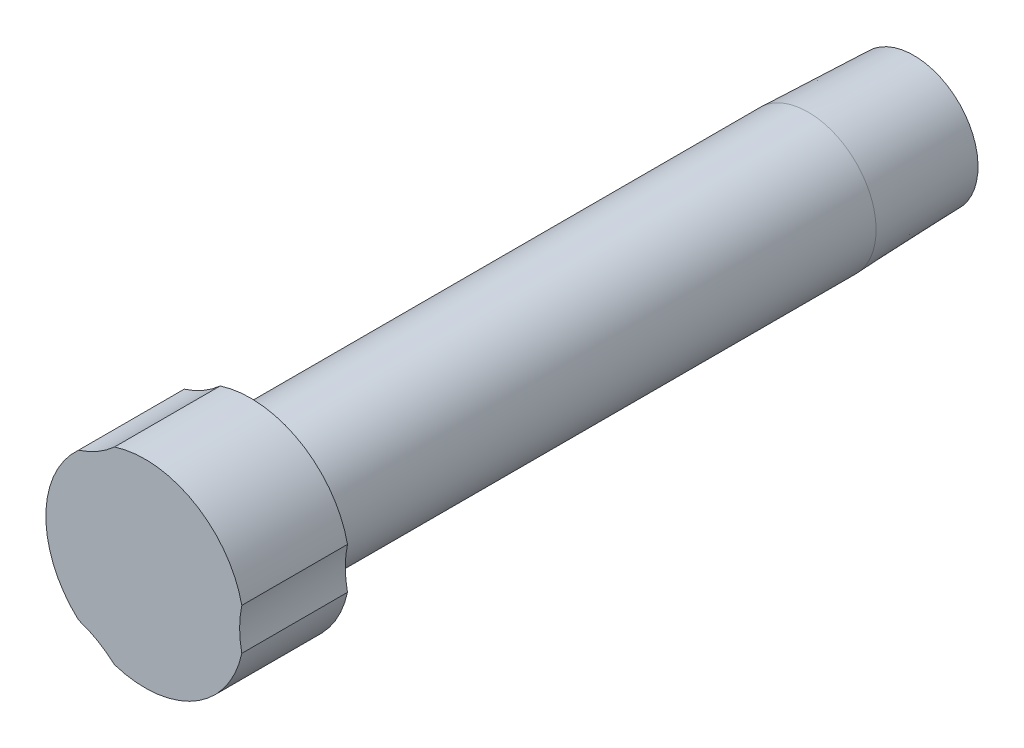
ISO-10303-21;
HEADER;
FILE_DESCRIPTION(('STEP AP214'),'2;1');
FILE_NAME('part.step','',(''),(''),'','','');
FILE_SCHEMA(('AUTOMOTIVE_DESIGN { 1 0 10303 214 1 1 1 1 }'));
ENDSEC;
DATA;
#1=APPLICATION_CONTEXT('core data for automotive mechanical design processes');
#2=APPLICATION_PROTOCOL_DEFINITION('international standard','automotive_design',2000,#1);
#3=PRODUCT_CONTEXT('',#1,'mechanical');
#4=PRODUCT('Part','Part','',(#3));
#5=PRODUCT_RELATED_PRODUCT_CATEGORY('part','',(#4));
#6=PRODUCT_DEFINITION_FORMATION('','',#4);
#7=PRODUCT_DEFINITION_CONTEXT('part definition',#1,'design');
#8=PRODUCT_DEFINITION('design','',#6,#7);
#9=PRODUCT_DEFINITION_SHAPE('','',#8);
#10=(LENGTH_UNIT() NAMED_UNIT(*) SI_UNIT(.MILLI.,.METRE.));
#11=(NAMED_UNIT(*) PLANE_ANGLE_UNIT() SI_UNIT($,.RADIAN.));
#12=(NAMED_UNIT(*) SI_UNIT($,.STERADIAN.) SOLID_ANGLE_UNIT());
#13=UNCERTAINTY_MEASURE_WITH_UNIT(LENGTH_MEASURE(1.E-05),#10,'distance_accuracy_value','');
#14=(GEOMETRIC_REPRESENTATION_CONTEXT(3) GLOBAL_UNCERTAINTY_ASSIGNED_CONTEXT((#13)) GLOBAL_UNIT_ASSIGNED_CONTEXT((#10,
#11,#12)) REPRESENTATION_CONTEXT('',''));
#15=CARTESIAN_POINT('',(0.,0.,0.));
#16=DIRECTION('',(0.,0.,1.));
#17=DIRECTION('',(1.,0.,0.));
#18=AXIS2_PLACEMENT_3D('',#15,#16,#17);
#19=CARTESIAN_POINT('',(-1.83333333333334,43.,0.));
#20=DIRECTION('',(0.,0.,1.));
#21=DIRECTION('',(1.,0.,0.));
#22=AXIS2_PLACEMENT_3D('',#19,#20,#21);
#23=PLANE('',#22);
#24=CARTESIAN_POINT('',(-1.83333333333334,43.,0.));
#25=DIRECTION('',(0.,0.,1.));
#26=DIRECTION('',(1.,0.,0.));
#27=AXIS2_PLACEMENT_3D('',#24,#25,#26);
#28=CIRCLE('',#27,2.57);
#29=CARTESIAN_POINT('',(0.736666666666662,43.,0.));
#30=VERTEX_POINT('',#29);
#31=EDGE_CURVE('E114',#30,#30,#28,.T.);
#32=ORIENTED_EDGE('',*,*,#31,.T.);
#33=EDGE_LOOP('',(#32));
#34=FACE_BOUND('',#33,.T.);
#35=CARTESIAN_POINT('',(-5.50000000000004,49.3508529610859,0.));
#36=DIRECTION('',(0.,0.,1.));
#37=DIRECTION('',(1.,0.,0.));
#38=AXIS2_PLACEMENT_3D('',#35,#36,#37);
#39=CIRCLE('',#38,3.75);
#40=CARTESIAN_POINT('',(-4.34750560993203,45.7823439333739,0.));
#41=VERTEX_POINT('',#40);
#42=CARTESIAN_POINT('',(-2.98582772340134,46.568509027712,0.));
#43=VERTEX_POINT('',#42);
#44=EDGE_CURVE('E91',#41,#43,#39,.T.);
#45=ORIENTED_EDGE('',*,*,#44,.T.);
#46=CARTESIAN_POINT('',(-1.83333333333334,43.,0.));
#47=DIRECTION('',(0.,0.,1.));
#48=DIRECTION('',(1.,0.,0.));
#49=AXIS2_PLACEMENT_3D('',#46,#47,#48);
#50=CIRCLE('',#49,3.75);
#51=CARTESIAN_POINT('',(1.83333333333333,43.786165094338,1.90993054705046E-11));
#52=VERTEX_POINT('',#51);
#53=EDGE_CURVE('E100',#52,#43,#50,.T.);
#54=ORIENTED_EDGE('',*,*,#53,.F.);
#55=CARTESIAN_POINT('',(5.5,43.,1.90993054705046E-11));
#56=DIRECTION('',(0.,0.,1.));
#57=DIRECTION('',(1.,0.,0.));
#58=AXIS2_PLACEMENT_3D('',#55,#56,#57);
#59=CIRCLE('',#58,3.75);
#60=CARTESIAN_POINT('',(1.83333333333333,42.213834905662,1.90993054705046E-11));
#61=VERTEX_POINT('',#60);
#62=EDGE_CURVE('E240',#52,#61,#59,.T.);
#63=ORIENTED_EDGE('',*,*,#62,.T.);
#64=CARTESIAN_POINT('',(-2.98582772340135,39.431490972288,1.90993054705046E-11));
#65=VERTEX_POINT('',#64);
#66=EDGE_CURVE('E111',#65,#61,#50,.T.);
#67=ORIENTED_EDGE('',*,*,#66,.F.);
#68=CARTESIAN_POINT('',(-5.50000000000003,36.6491470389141,1.90993054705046E-11));
#69=DIRECTION('',(0.,0.,1.));
#70=DIRECTION('',(1.,0.,0.));
#71=AXIS2_PLACEMENT_3D('',#68,#69,#70);
#72=CIRCLE('',#71,3.75);
#73=CARTESIAN_POINT('',(-4.34750560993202,40.2176560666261,1.90993054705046E-11));
#74=VERTEX_POINT('',#73);
#75=EDGE_CURVE('E101',#65,#74,#72,.T.);
#76=ORIENTED_EDGE('',*,*,#75,.T.);
#77=EDGE_CURVE('E109',#41,#74,#50,.T.);
#78=ORIENTED_EDGE('',*,*,#77,.F.);
#79=EDGE_LOOP('',(#45,#54,#63,#67,#76,#78));
#80=FACE_BOUND('',#79,.T.);
#81=ADVANCED_FACE('F33',(#34,#80),#23,.F.);
#82=CARTESIAN_POINT('',(-1.83333333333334,43.,14.6066017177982));
#83=DIRECTION('',(0.,0.,-1.));
#84=DIRECTION('',(-1.,0.,0.));
#85=AXIS2_PLACEMENT_3D('',#82,#83,#84);
#86=CYLINDRICAL_SURFACE('',#85,3.75);
#87=DIRECTION('',(0.,0.,-1.));
#88=VECTOR('',#87,1.);
#89=CARTESIAN_POINT('',(-2.98582772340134,46.568509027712,2.));
#90=LINE('',#89,#88);
#91=CARTESIAN_POINT('',(-2.98582772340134,46.568509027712,4.));
#92=VERTEX_POINT('',#91);
#93=EDGE_CURVE('E85',#92,#43,#90,.T.);
#94=ORIENTED_EDGE('',*,*,#93,.F.);
#95=CARTESIAN_POINT('',(-1.83333333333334,43.,4.));
#96=DIRECTION('',(0.,0.,-1.));
#97=DIRECTION('',(-1.,0.,0.));
#98=AXIS2_PLACEMENT_3D('',#95,#96,#97);
#99=CIRCLE('',#98,3.75);
#100=CARTESIAN_POINT('',(1.83333333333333,43.786165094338,4.));
#101=VERTEX_POINT('',#100);
#102=EDGE_CURVE('E97',#92,#101,#99,.T.);
#103=ORIENTED_EDGE('',*,*,#102,.T.);
#104=DIRECTION('',(0.,0.,-1.));
#105=VECTOR('',#104,1.);
#106=CARTESIAN_POINT('',(1.83333333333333,43.786165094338,2.0000000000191));
#107=LINE('',#106,#105);
#108=EDGE_CURVE('E251',#52,#101,#107,.F.);
#109=ORIENTED_EDGE('',*,*,#108,.F.);
#110=ORIENTED_EDGE('',*,*,#53,.T.);
#111=EDGE_LOOP('',(#94,#103,#109,#110));
#112=FACE_BOUND('',#111,.T.);
#113=ADVANCED_FACE('F95',(#112),#86,.T.);
#114=DIRECTION('',(0.,0.,-1.));
#115=VECTOR('',#114,1.);
#116=CARTESIAN_POINT('',(-4.34750560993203,45.7823439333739,2.));
#117=LINE('',#116,#115);
#118=CARTESIAN_POINT('',(-4.34750560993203,45.7823439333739,4.));
#119=VERTEX_POINT('',#118);
#120=EDGE_CURVE('E48',#41,#119,#117,.F.);
#121=ORIENTED_EDGE('',*,*,#120,.F.);
#122=ORIENTED_EDGE('',*,*,#77,.T.);
#123=DIRECTION('',(0.,0.,-1.));
#124=VECTOR('',#123,1.);
#125=CARTESIAN_POINT('',(-4.34750560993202,40.2176560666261,2.0000000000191));
#126=LINE('',#125,#124);
#127=CARTESIAN_POINT('',(-4.34750560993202,40.2176560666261,4.0000000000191));
#128=VERTEX_POINT('',#127);
#129=EDGE_CURVE('E237',#128,#74,#126,.T.);
#130=ORIENTED_EDGE('',*,*,#129,.F.);
#131=EDGE_CURVE('E106',#128,#119,#99,.T.);
#132=ORIENTED_EDGE('',*,*,#131,.T.);
#133=EDGE_LOOP('',(#121,#122,#130,#132));
#134=FACE_BOUND('',#133,.T.);
#135=ADVANCED_FACE('F141',(#134),#86,.T.);
#136=CARTESIAN_POINT('',(-27.5,68.,4.));
#137=DIRECTION('',(0.,0.,-1.));
#138=DIRECTION('',(-1.,0.,0.));
#139=AXIS2_PLACEMENT_3D('',#136,#137,#138);
#140=PLANE('',#139);
#141=CARTESIAN_POINT('',(-5.50000000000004,49.3508529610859,4.));
#142=DIRECTION('',(0.,0.,-1.));
#143=DIRECTION('',(-1.,0.,0.));
#144=AXIS2_PLACEMENT_3D('',#141,#142,#143);
#145=CIRCLE('',#144,3.75);
#146=EDGE_CURVE('E82',#92,#119,#145,.T.);
#147=ORIENTED_EDGE('',*,*,#146,.T.);
#148=ORIENTED_EDGE('',*,*,#131,.F.);
#149=CARTESIAN_POINT('',(-5.50000000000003,36.6491470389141,4.0000000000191));
#150=DIRECTION('',(0.,0.,-1.));
#151=DIRECTION('',(-1.,0.,0.));
#152=AXIS2_PLACEMENT_3D('',#149,#150,#151);
#153=CIRCLE('',#152,3.75);
#154=CARTESIAN_POINT('',(-2.98582772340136,39.431490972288,4.));
#155=VERTEX_POINT('',#154);
#156=EDGE_CURVE('E239',#128,#155,#153,.T.);
#157=ORIENTED_EDGE('',*,*,#156,.T.);
#158=CARTESIAN_POINT('',(1.83333333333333,42.213834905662,4.0000000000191));
#159=VERTEX_POINT('',#158);
#160=EDGE_CURVE('E108',#159,#155,#99,.T.);
#161=ORIENTED_EDGE('',*,*,#160,.F.);
#162=CARTESIAN_POINT('',(5.5,43.,4.));
#163=DIRECTION('',(0.,0.,-1.));
#164=DIRECTION('',(-1.,0.,0.));
#165=AXIS2_PLACEMENT_3D('',#162,#163,#164);
#166=CIRCLE('',#165,3.75);
#167=EDGE_CURVE('E11',#101,#159,#166,.F.);
#168=ORIENTED_EDGE('',*,*,#167,.F.);
#169=ORIENTED_EDGE('',*,*,#102,.F.);
#170=EDGE_LOOP('',(#147,#148,#157,#161,#168,#169));
#171=FACE_BOUND('',#170,.T.);
#172=ADVANCED_FACE('F104',(#171),#140,.F.);
#173=DIRECTION('',(0.,0.,-1.));
#174=VECTOR('',#173,1.);
#175=CARTESIAN_POINT('',(-2.98582772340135,39.431490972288,2.0000000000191));
#176=LINE('',#175,#174);
#177=EDGE_CURVE('E56',#65,#155,#176,.F.);
#178=ORIENTED_EDGE('',*,*,#177,.F.);
#179=ORIENTED_EDGE('',*,*,#66,.T.);
#180=DIRECTION('',(0.,0.,-1.));
#181=VECTOR('',#180,1.);
#182=CARTESIAN_POINT('',(1.83333333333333,42.213834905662,2.0000000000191));
#183=LINE('',#182,#181);
#184=EDGE_CURVE('E253',#159,#61,#183,.T.);
#185=ORIENTED_EDGE('',*,*,#184,.F.);
#186=ORIENTED_EDGE('',*,*,#160,.T.);
#187=EDGE_LOOP('',(#178,#179,#185,#186));
#188=FACE_BOUND('',#187,.T.);
#189=ADVANCED_FACE('F132',(#188),#86,.T.);
#190=CARTESIAN_POINT('',(-3.66666666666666,39.824573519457,-25.1));
#191=DIRECTION('',(0.,0.,-1.));
#192=DIRECTION('',(0.866025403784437,0.500000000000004,0.));
#193=AXIS2_PLACEMENT_3D('',#190,#191,#192);
#194=PLANE('',#193);
#195=CARTESIAN_POINT('',(-1.83333333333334,43.,-25.1));
#196=DIRECTION('',(0.,0.,-1.));
#197=DIRECTION('',(0.866025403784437,0.500000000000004,0.));
#198=AXIS2_PLACEMENT_3D('',#195,#196,#197);
#199=CIRCLE('',#198,2.4301584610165);
#200=CARTESIAN_POINT('',(0.271245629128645,44.2150792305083,-25.1));
#201=VERTEX_POINT('',#200);
#202=EDGE_CURVE('E122',#201,#201,#199,.F.);
#203=ORIENTED_EDGE('',*,*,#202,.F.);
#204=EDGE_LOOP('',(#203));
#205=FACE_BOUND('',#204,.T.);
#206=ADVANCED_FACE('F130',(#205),#194,.T.);
#207=CARTESIAN_POINT('',(-1.83333333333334,43.,-23.1));
#208=DIRECTION('',(0.,0.,1.));
#209=DIRECTION('',(0.866025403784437,0.500000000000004,0.));
#210=AXIS2_PLACEMENT_3D('',#207,#208,#209);
#211=CONICAL_SURFACE('',#210,2.5,0.0349065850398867);
#212=CARTESIAN_POINT('',(-1.83333333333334,43.,-21.1));
#213=DIRECTION('',(0.,0.,-1.));
#214=DIRECTION('',(0.866025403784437,0.500000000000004,0.));
#215=AXIS2_PLACEMENT_3D('',#212,#213,#214);
#216=CIRCLE('',#215,2.5698415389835);
#217=CARTESIAN_POINT('',(0.392214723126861,44.2849207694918,-21.1));
#218=VERTEX_POINT('',#217);
#219=EDGE_CURVE('E41',#218,#218,#216,.T.);
#220=ORIENTED_EDGE('',*,*,#219,.T.);
#221=EDGE_LOOP('',(#220));
#222=FACE_BOUND('',#221,.T.);
#223=ORIENTED_EDGE('',*,*,#202,.T.);
#224=EDGE_LOOP('',(#223));
#225=FACE_BOUND('',#224,.T.);
#226=ADVANCED_FACE('F35',(#222,#225),#211,.T.);
#227=CARTESIAN_POINT('',(-5.50000000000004,49.3508529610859,-21.1));
#228=DIRECTION('',(0.,0.,1.));
#229=DIRECTION('',(-0.866025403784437,-0.500000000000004,0.));
#230=AXIS2_PLACEMENT_3D('',#227,#228,#229);
#231=PLANE('',#230);
#232=CARTESIAN_POINT('',(-1.83333333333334,43.,-21.0999999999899));
#233=DIRECTION('',(0.,0.,1.));
#234=DIRECTION('',(0.,-1.,0.));
#235=AXIS2_PLACEMENT_3D('',#232,#233,#234);
#236=CIRCLE('',#235,2.57);
#237=CARTESIAN_POINT('',(0.736666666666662,43.,-21.1000000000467));
#238=VERTEX_POINT('',#237);
#239=EDGE_CURVE('E118',#238,#238,#236,.F.);
#240=ORIENTED_EDGE('',*,*,#239,.T.);
#241=EDGE_LOOP('',(#240));
#242=FACE_BOUND('',#241,.T.);
#243=ORIENTED_EDGE('',*,*,#219,.F.);
#244=EDGE_LOOP('',(#243));
#245=FACE_BOUND('',#244,.T.);
#246=ADVANCED_FACE('F138',(#242,#245),#231,.F.);
#247=CARTESIAN_POINT('',(-1.83333333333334,43.,-500000.));
#248=DIRECTION('',(0.,0.,1.));
#249=DIRECTION('',(1.,0.,0.));
#250=AXIS2_PLACEMENT_3D('',#247,#248,#249);
#251=CYLINDRICAL_SURFACE('',#250,2.57);
#252=CARTESIAN_POINT('',(0.736666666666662,43.,-21.1000000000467));
#253=CARTESIAN_POINT('',(0.736666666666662,43.,-20.8802083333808));
#254=CARTESIAN_POINT('',(0.736666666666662,43.,-20.6604166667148));
#255=CARTESIAN_POINT('',(0.736666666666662,43.,-20.2208333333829));
#256=CARTESIAN_POINT('',(0.736666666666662,43.,-20.0010416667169));
#257=CARTESIAN_POINT('',(0.736666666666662,43.,-19.561458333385));
#258=CARTESIAN_POINT('',(0.736666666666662,43.,-19.341666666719));
#259=CARTESIAN_POINT('',(0.736666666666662,43.,-18.9020833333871));
#260=CARTESIAN_POINT('',(0.736666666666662,43.,-18.6822916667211));
#261=CARTESIAN_POINT('',(0.736666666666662,43.,-18.2427083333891));
#262=CARTESIAN_POINT('',(0.736666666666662,43.,-18.0229166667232));
#263=CARTESIAN_POINT('',(0.736666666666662,43.,-17.5833333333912));
#264=CARTESIAN_POINT('',(0.736666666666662,43.,-17.3635416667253));
#265=CARTESIAN_POINT('',(0.736666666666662,43.,-16.9239583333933));
#266=CARTESIAN_POINT('',(0.736666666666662,43.,-16.7041666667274));
#267=CARTESIAN_POINT('',(0.736666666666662,43.,-16.2645833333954));
#268=CARTESIAN_POINT('',(0.736666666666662,43.,-16.0447916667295));
#269=CARTESIAN_POINT('',(0.736666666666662,43.,-15.6052083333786));
#270=CARTESIAN_POINT('',(0.736666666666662,43.,-15.3854166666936));
#271=CARTESIAN_POINT('',(0.736666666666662,43.,-14.9458333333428));
#272=CARTESIAN_POINT('',(0.736666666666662,43.,-14.7260416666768));
#273=CARTESIAN_POINT('',(0.736666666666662,43.,-14.2864583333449));
#274=CARTESIAN_POINT('',(0.736666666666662,43.,-14.0666666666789));
#275=CARTESIAN_POINT('',(0.736666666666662,43.,-13.6270833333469));
#276=CARTESIAN_POINT('',(0.736666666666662,43.,-13.407291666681));
#277=CARTESIAN_POINT('',(0.736666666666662,43.,-12.967708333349));
#278=CARTESIAN_POINT('',(0.736666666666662,43.,-12.7479166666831));
#279=CARTESIAN_POINT('',(0.736666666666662,43.,-12.3083333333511));
#280=CARTESIAN_POINT('',(0.736666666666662,43.,-12.0885416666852));
#281=CARTESIAN_POINT('',(0.736666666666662,43.,-11.6489583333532));
#282=CARTESIAN_POINT('',(0.736666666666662,43.,-11.4291666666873));
#283=CARTESIAN_POINT('',(0.736666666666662,43.,-10.9895833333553));
#284=CARTESIAN_POINT('',(0.736666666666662,43.,-10.7697916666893));
#285=CARTESIAN_POINT('',(0.736666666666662,43.,-10.3302083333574));
#286=CARTESIAN_POINT('',(0.736666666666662,43.,-10.1104166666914));
#287=CARTESIAN_POINT('',(0.736666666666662,43.,-9.6708333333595));
#288=CARTESIAN_POINT('',(0.736666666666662,43.,-9.45104166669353));
#289=CARTESIAN_POINT('',(0.736666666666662,43.,-9.01145833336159));
#290=CARTESIAN_POINT('',(0.736666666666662,43.,-8.79166666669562));
#291=CARTESIAN_POINT('',(0.736666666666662,43.,-8.35208333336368));
#292=CARTESIAN_POINT('',(0.736666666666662,43.,-8.13229166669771));
#293=CARTESIAN_POINT('',(0.736666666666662,43.,-7.69270833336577));
#294=CARTESIAN_POINT('',(0.736666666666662,43.,-7.4729166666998));
#295=CARTESIAN_POINT('',(0.736666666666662,43.,-7.03333333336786));
#296=CARTESIAN_POINT('',(0.736666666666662,43.,-6.81354166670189));
#297=CARTESIAN_POINT('',(0.736666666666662,43.,-6.37395833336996));
#298=CARTESIAN_POINT('',(0.736666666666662,43.,-6.15416666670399));
#299=CARTESIAN_POINT('',(0.736666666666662,43.,-5.7145833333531));
#300=CARTESIAN_POINT('',(0.736666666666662,43.,-5.49479166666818));
#301=CARTESIAN_POINT('',(0.736666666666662,43.,-5.0552083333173));
#302=CARTESIAN_POINT('',(0.736666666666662,43.,-4.83541666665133));
#303=CARTESIAN_POINT('',(0.736666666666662,43.,-4.39583333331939));
#304=CARTESIAN_POINT('',(0.736666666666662,43.,-4.17604166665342));
#305=CARTESIAN_POINT('',(0.736666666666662,43.,-3.73645833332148));
#306=CARTESIAN_POINT('',(0.736666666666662,43.,-3.51666666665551));
#307=CARTESIAN_POINT('',(0.736666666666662,43.,-3.07708333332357));
#308=CARTESIAN_POINT('',(0.736666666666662,43.,-2.8572916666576));
#309=CARTESIAN_POINT('',(0.736666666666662,43.,-2.41770833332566));
#310=CARTESIAN_POINT('',(0.736666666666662,43.,-2.19791666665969));
#311=CARTESIAN_POINT('',(0.736666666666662,43.,-1.75833333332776));
#312=CARTESIAN_POINT('',(0.736666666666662,43.,-1.53854166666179));
#313=CARTESIAN_POINT('',(0.736666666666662,43.,-1.09895833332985));
#314=CARTESIAN_POINT('',(0.736666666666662,43.,-0.879166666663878));
#315=CARTESIAN_POINT('',(0.736666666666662,43.,-0.439583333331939));
#316=CARTESIAN_POINT('',(0.736666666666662,43.,-0.219791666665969));
#317=CARTESIAN_POINT('',(0.736666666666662,43.,0.));
#318=B_SPLINE_CURVE_WITH_KNOTS('',3,(#252,#253,#254,#255,#256,#257,#258,#259,#260,#261,#262,
#263,#264,#265,#266,#267,#268,#269,#270,#271,#272,#273,#274,#275,#276,#277,#278,#279,#280,#281,
#282,#283,#284,#285,#286,#287,#288,#289,#290,#291,#292,#293,#294,#295,#296,#297,#298,#299,#300,
#301,#302,#303,#304,#305,#306,#307,#308,#309,#310,#311,#312,#313,#314,#315,#316,#317),
.UNSPECIFIED.,.F.,.F.,(4,2,2,2,2,2,2,2,2,2,2,2,2,2,2,2,2,2,2,2,2,2,2,2,2,2,2,2,2,2,2,2,4),(0.,
0.659374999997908,1.31874999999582,1.97812499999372,2.63749999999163,3.29687499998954,
3.95624999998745,4.61562499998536,5.27499999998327,5.93437500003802,6.59375000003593,
7.25312500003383,7.91250000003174,8.57187500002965,9.23125000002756,9.89062500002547,
10.5500000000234,11.2093750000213,11.8687500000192,12.5281250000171,13.187500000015,
13.8468750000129,14.5062500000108,15.1656250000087,15.8250000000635,16.4843750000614,
17.1437500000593,17.8031250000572,18.4625000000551,19.121875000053,19.7812500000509,
20.4406250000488,21.1000000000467),.UNSPECIFIED.);
#319=EDGE_CURVE('BSEAM151',#238,#30,#318,.T.);
#320=ORIENTED_EDGE('',*,*,#239,.F.);
#321=ORIENTED_EDGE('',*,*,#31,.F.);
#322=ORIENTED_EDGE('',*,*,#319,.T.);
#323=ORIENTED_EDGE('',*,*,#319,.F.);
#324=EDGE_LOOP('',(#320,#322,#321,#323));
#325=FACE_BOUND('',#324,.T.);
#326=ADVANCED_FACE('F151',(#325),#251,.T.);
#327=CARTESIAN_POINT('',(5.5,43.,14.6066017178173));
#328=DIRECTION('',(0.,0.,-1.));
#329=DIRECTION('',(-1.,0.,0.));
#330=AXIS2_PLACEMENT_3D('',#327,#328,#329);
#331=CYLINDRICAL_SURFACE('',#330,3.75);
#332=ORIENTED_EDGE('',*,*,#184,.T.);
#333=ORIENTED_EDGE('',*,*,#62,.F.);
#334=ORIENTED_EDGE('',*,*,#108,.T.);
#335=ORIENTED_EDGE('',*,*,#167,.T.);
#336=EDGE_LOOP('',(#332,#333,#334,#335));
#337=FACE_BOUND('',#336,.T.);
#338=ADVANCED_FACE('F153',(#337),#331,.F.);
#339=CARTESIAN_POINT('',(-5.50000000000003,36.6491470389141,14.6066017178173));
#340=DIRECTION('',(0.,0.,-1.));
#341=DIRECTION('',(-1.,0.,0.));
#342=AXIS2_PLACEMENT_3D('',#339,#340,#341);
#343=CYLINDRICAL_SURFACE('',#342,3.75);
#344=ORIENTED_EDGE('',*,*,#129,.T.);
#345=ORIENTED_EDGE('',*,*,#75,.F.);
#346=ORIENTED_EDGE('',*,*,#177,.T.);
#347=ORIENTED_EDGE('',*,*,#156,.F.);
#348=EDGE_LOOP('',(#344,#345,#346,#347));
#349=FACE_BOUND('',#348,.T.);
#350=ADVANCED_FACE('F159',(#349),#343,.F.);
#351=CARTESIAN_POINT('',(-5.50000000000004,49.3508529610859,14.6066017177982));
#352=DIRECTION('',(0.,0.,-1.));
#353=DIRECTION('',(-1.,0.,0.));
#354=AXIS2_PLACEMENT_3D('',#351,#352,#353);
#355=CYLINDRICAL_SURFACE('',#354,3.75);
#356=ORIENTED_EDGE('',*,*,#93,.T.);
#357=ORIENTED_EDGE('',*,*,#44,.F.);
#358=ORIENTED_EDGE('',*,*,#120,.T.);
#359=ORIENTED_EDGE('',*,*,#146,.F.);
#360=EDGE_LOOP('',(#356,#357,#358,#359));
#361=FACE_BOUND('',#360,.T.);
#362=ADVANCED_FACE('F84',(#361),#355,.F.);
#363=CLOSED_SHELL('',(#81,#113,#135,#172,#189,#206,#226,#246,#326,#338,#350,#362));
#364=MANIFOLD_SOLID_BREP('B2',#363);
#365=ADVANCED_BREP_SHAPE_REPRESENTATION('',(#18,#364),#14);
#366=SHAPE_DEFINITION_REPRESENTATION(#9,#365);
ENDSEC;
END-ISO-10303-21;
